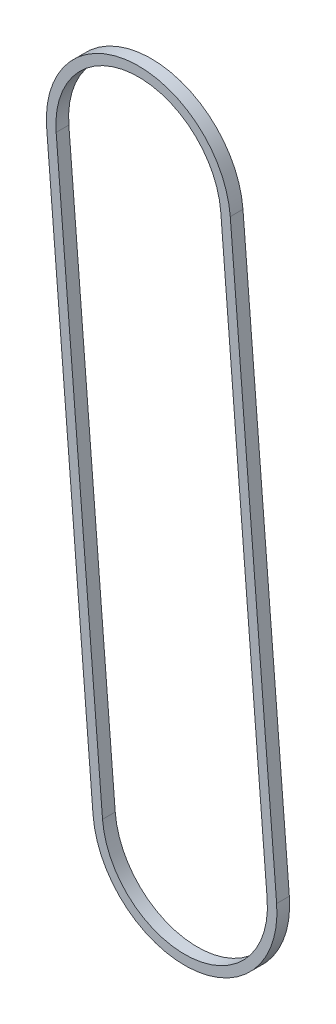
from build123d import *

# Parameters (mm, degrees)
BOSS_EXTRUDE1_DEPTH = 10


with BuildPart() as part:
    # Sketch1 → Boss-Extrude1 (new, symmetric)
    with BuildSketch(Plane.XY):
        with BuildLine():
            Line((-217.525362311, 888.277387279), (-144.525362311, -11.722612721))
            ThreePointArc((-144.525362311, -11.722612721), (11.722612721, -144.525362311), (144.525362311, 11.722612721))
            Line((144.525362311, 11.722612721), (71.525362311, 911.722612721))
            ThreePointArc((71.525362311, 911.722612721), (-84.722612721, 1044.525362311), (-217.525362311, 888.277387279))
        make_face()
        with BuildLine():
            Line((-202.574462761, 889.490071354), (-129.574462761, -10.509928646))
            ThreePointArc((-129.574462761, -10.509928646), (10.509928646, -129.574462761), (129.574462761, 10.509928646))
            Line((129.574462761, 10.509928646), (56.574462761, 910.509928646))
            ThreePointArc((56.574462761, 910.509928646), (-83.509928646, 1029.574462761), (-202.574462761, 889.490071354))
        make_face(mode=Mode.SUBTRACT)
    extrude(amount=BOSS_EXTRUDE1_DEPTH, both=True)


solid = part.part
